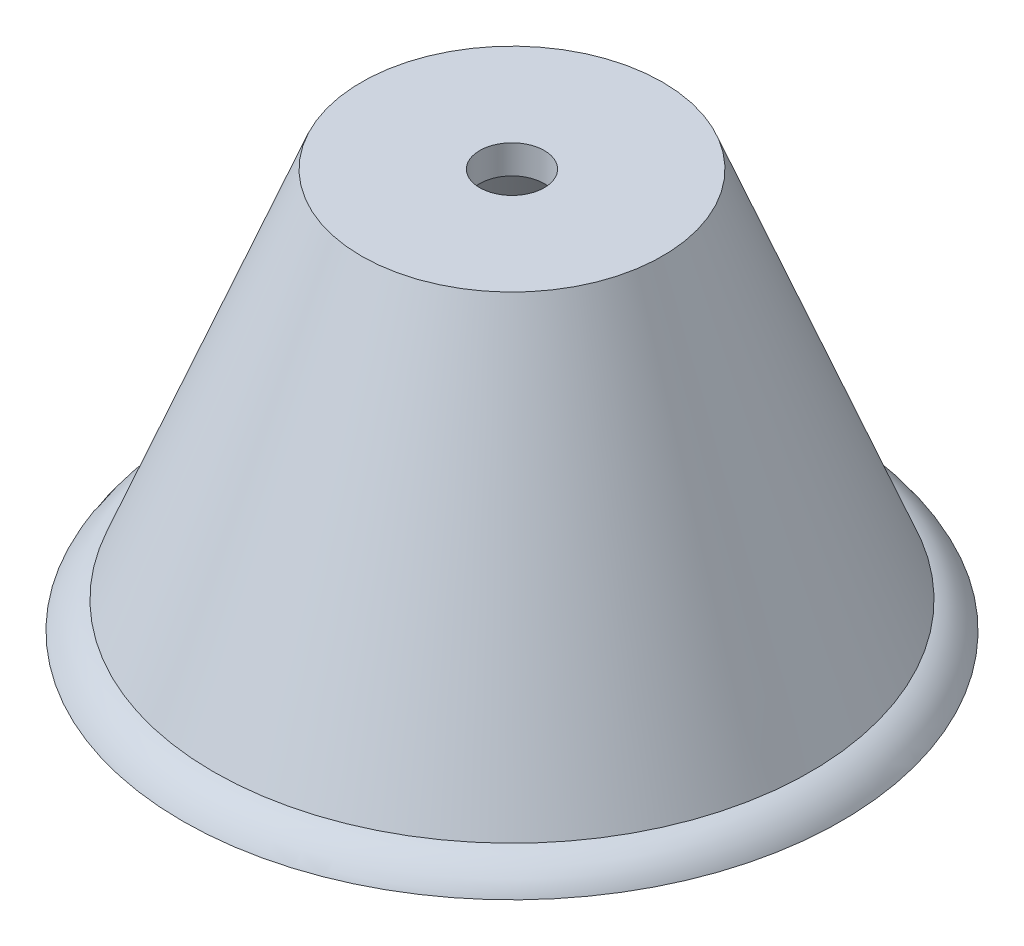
ISO-10303-21;
HEADER;
FILE_DESCRIPTION(('STEP AP214'),'2;1');
FILE_NAME('part.step','',(''),(''),'','','');
FILE_SCHEMA(('AUTOMOTIVE_DESIGN { 1 0 10303 214 1 1 1 1 }'));
ENDSEC;
DATA;
#1=APPLICATION_CONTEXT('core data for automotive mechanical design processes');
#2=APPLICATION_PROTOCOL_DEFINITION('international standard','automotive_design',2000,#1);
#3=PRODUCT_CONTEXT('',#1,'mechanical');
#4=PRODUCT('Part','Part','',(#3));
#5=PRODUCT_RELATED_PRODUCT_CATEGORY('part','',(#4));
#6=PRODUCT_DEFINITION_FORMATION('','',#4);
#7=PRODUCT_DEFINITION_CONTEXT('part definition',#1,'design');
#8=PRODUCT_DEFINITION('design','',#6,#7);
#9=PRODUCT_DEFINITION_SHAPE('','',#8);
#10=(LENGTH_UNIT() NAMED_UNIT(*) SI_UNIT(.MILLI.,.METRE.));
#11=(NAMED_UNIT(*) PLANE_ANGLE_UNIT() SI_UNIT($,.RADIAN.));
#12=(NAMED_UNIT(*) SI_UNIT($,.STERADIAN.) SOLID_ANGLE_UNIT());
#13=UNCERTAINTY_MEASURE_WITH_UNIT(LENGTH_MEASURE(1.E-05),#10,'distance_accuracy_value','');
#14=(GEOMETRIC_REPRESENTATION_CONTEXT(3) GLOBAL_UNCERTAINTY_ASSIGNED_CONTEXT((#13)) GLOBAL_UNIT_ASSIGNED_CONTEXT((#10,
#11,#12)) REPRESENTATION_CONTEXT('',''));
#15=CARTESIAN_POINT('',(0.,0.,0.));
#16=DIRECTION('',(0.,0.,1.));
#17=DIRECTION('',(1.,0.,0.));
#18=AXIS2_PLACEMENT_3D('',#15,#16,#17);
#19=CARTESIAN_POINT('',(0.,6.05139598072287,0.));
#20=DIRECTION('',(0.,1.,0.));
#21=DIRECTION('',(0.,0.,1.));
#22=AXIS2_PLACEMENT_3D('',#19,#20,#21);
#23=PLANE('',#22);
#24=CARTESIAN_POINT('',(0.,6.05139598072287,0.));
#25=DIRECTION('',(0.,-1.,0.));
#26=DIRECTION('',(0.,0.,-1.));
#27=AXIS2_PLACEMENT_3D('',#24,#25,#26);
#28=CIRCLE('',#27,4.92799404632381);
#29=CARTESIAN_POINT('',(0.,6.05139598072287,-4.92799404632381));
#30=VERTEX_POINT('',#29);
#31=EDGE_CURVE('E53',#30,#30,#28,.T.);
#32=ORIENTED_EDGE('',*,*,#31,.F.);
#33=EDGE_LOOP('',(#32));
#34=FACE_BOUND('',#33,.T.);
#35=CARTESIAN_POINT('',(0.,6.05139598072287,0.));
#36=DIRECTION('',(0.,-1.,0.));
#37=DIRECTION('',(0.,0.,-1.));
#38=AXIS2_PLACEMENT_3D('',#35,#36,#37);
#39=CIRCLE('',#38,5.83544876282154);
#40=CARTESIAN_POINT('',(0.,6.05139598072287,-5.83544876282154));
#41=VERTEX_POINT('',#40);
#42=EDGE_CURVE('E10',#41,#41,#39,.T.);
#43=ORIENTED_EDGE('',*,*,#42,.T.);
#44=EDGE_LOOP('',(#43));
#45=FACE_BOUND('',#44,.T.);
#46=ADVANCED_FACE('F34',(#34,#45),#23,.F.);
#47=CARTESIAN_POINT('',(0.,5.69518983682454,0.));
#48=DIRECTION('',(0.,-1.,0.));
#49=DIRECTION('',(0.,0.,-1.));
#50=AXIS2_PLACEMENT_3D('',#47,#48,#49);
#51=TOROIDAL_SURFACE('',#50,5.04232932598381,0.869437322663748);
#52=CARTESIAN_POINT('',(0.,6.53018884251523,0.));
#53=DIRECTION('',(0.,-1.,0.));
#54=DIRECTION('',(0.,0.,-1.));
#55=AXIS2_PLACEMENT_3D('',#52,#53,#54);
#56=CIRCLE('',#55,5.28460585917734);
#57=CARTESIAN_POINT('',(0.,6.53018884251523,-5.28460585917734));
#58=VERTEX_POINT('',#57);
#59=EDGE_CURVE('E41',#58,#58,#56,.T.);
#60=ORIENTED_EDGE('',*,*,#59,.T.);
#61=EDGE_LOOP('',(#60));
#62=FACE_BOUND('',#61,.T.);
#63=ORIENTED_EDGE('',*,*,#42,.F.);
#64=EDGE_LOOP('',(#63));
#65=FACE_BOUND('',#64,.T.);
#66=ADVANCED_FACE('F82',(#62,#65),#51,.T.);
#67=CARTESIAN_POINT('',(0.,13.1307286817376,0.));
#68=DIRECTION('',(0.,-1.,0.));
#69=DIRECTION('',(0.,0.,-1.));
#70=AXIS2_PLACEMENT_3D('',#67,#68,#69);
#71=CONICAL_SURFACE('',#70,2.667,0.377549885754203);
#72=ORIENTED_EDGE('',*,*,#59,.F.);
#73=EDGE_LOOP('',(#72));
#74=FACE_BOUND('',#73,.T.);
#75=CARTESIAN_POINT('',(0.,13.1307286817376,0.));
#76=DIRECTION('',(0.,-1.,0.));
#77=DIRECTION('',(0.,0.,-1.));
#78=AXIS2_PLACEMENT_3D('',#75,#76,#77);
#79=CIRCLE('',#78,2.667);
#80=CARTESIAN_POINT('',(0.,13.1307286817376,-2.667));
#81=VERTEX_POINT('',#80);
#82=EDGE_CURVE('E45',#81,#81,#79,.T.);
#83=ORIENTED_EDGE('',*,*,#82,.T.);
#84=EDGE_LOOP('',(#83));
#85=FACE_BOUND('',#84,.T.);
#86=ADVANCED_FACE('F87',(#74,#85),#71,.T.);
#87=CARTESIAN_POINT('',(0.,13.1307286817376,0.));
#88=DIRECTION('',(0.,-1.,0.));
#89=DIRECTION('',(0.,0.,-1.));
#90=AXIS2_PLACEMENT_3D('',#87,#88,#89);
#91=PLANE('',#90);
#92=CARTESIAN_POINT('',(0.,13.1307286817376,0.));
#93=DIRECTION('',(0.,-1.,0.));
#94=DIRECTION('',(0.,0.,-1.));
#95=AXIS2_PLACEMENT_3D('',#92,#93,#94);
#96=CIRCLE('',#95,0.5715);
#97=CARTESIAN_POINT('',(0.,13.1307286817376,-0.5715));
#98=VERTEX_POINT('',#97);
#99=EDGE_CURVE('E56',#98,#98,#96,.T.);
#100=ORIENTED_EDGE('',*,*,#99,.T.);
#101=EDGE_LOOP('',(#100));
#102=FACE_BOUND('',#101,.T.);
#103=ORIENTED_EDGE('',*,*,#82,.F.);
#104=EDGE_LOOP('',(#103));
#105=FACE_BOUND('',#104,.T.);
#106=ADVANCED_FACE('F70',(#102,#105),#91,.F.);
#107=CARTESIAN_POINT('',(0.,12.6227286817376,0.));
#108=DIRECTION('',(0.,-1.,0.));
#109=DIRECTION('',(0.,0.,-1.));
#110=AXIS2_PLACEMENT_3D('',#107,#108,#109);
#111=PLANE('',#110);
#112=CARTESIAN_POINT('',(0.,12.6227286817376,0.));
#113=DIRECTION('',(0.,-1.,0.));
#114=DIRECTION('',(0.,0.,-1.));
#115=AXIS2_PLACEMENT_3D('',#112,#113,#114);
#116=CIRCLE('',#115,0.5715);
#117=CARTESIAN_POINT('',(0.,12.6227286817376,-0.5715));
#118=VERTEX_POINT('',#117);
#119=EDGE_CURVE('E37',#118,#118,#116,.T.);
#120=ORIENTED_EDGE('',*,*,#119,.F.);
#121=EDGE_LOOP('',(#120));
#122=FACE_BOUND('',#121,.T.);
#123=CARTESIAN_POINT('',(0.,12.6227286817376,0.));
#124=DIRECTION('',(0.,-1.,0.));
#125=DIRECTION('',(0.,0.,-1.));
#126=AXIS2_PLACEMENT_3D('',#123,#124,#125);
#127=CIRCLE('',#126,2.32197099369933);
#128=CARTESIAN_POINT('',(0.,12.6227286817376,-2.32197099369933));
#129=VERTEX_POINT('',#128);
#130=EDGE_CURVE('E50',#129,#129,#127,.T.);
#131=ORIENTED_EDGE('',*,*,#130,.T.);
#132=EDGE_LOOP('',(#131));
#133=FACE_BOUND('',#132,.T.);
#134=ADVANCED_FACE('F66',(#122,#133),#111,.T.);
#135=CARTESIAN_POINT('',(0.,12.6227286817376,0.));
#136=DIRECTION('',(0.,-1.,0.));
#137=DIRECTION('',(0.,0.,-1.));
#138=AXIS2_PLACEMENT_3D('',#135,#136,#137);
#139=CONICAL_SURFACE('',#138,2.32197099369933,0.377549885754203);
#140=ORIENTED_EDGE('',*,*,#31,.T.);
#141=EDGE_LOOP('',(#140));
#142=FACE_BOUND('',#141,.T.);
#143=ORIENTED_EDGE('',*,*,#130,.F.);
#144=EDGE_LOOP('',(#143));
#145=FACE_BOUND('',#144,.T.);
#146=ADVANCED_FACE('F69',(#142,#145),#139,.F.);
#147=CARTESIAN_POINT('',(0.,-2.68214638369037,0.));
#148=DIRECTION('',(0.,-1.,0.));
#149=DIRECTION('',(0.,0.,-1.));
#150=AXIS2_PLACEMENT_3D('',#147,#148,#149);
#151=CYLINDRICAL_SURFACE('',#150,0.5715);
#152=ORIENTED_EDGE('',*,*,#119,.T.);
#153=EDGE_LOOP('',(#152));
#154=FACE_BOUND('',#153,.T.);
#155=ORIENTED_EDGE('',*,*,#99,.F.);
#156=EDGE_LOOP('',(#155));
#157=FACE_BOUND('',#156,.T.);
#158=ADVANCED_FACE('F63',(#154,#157),#151,.F.);
#159=CLOSED_SHELL('',(#46,#66,#86,#106,#134,#146,#158));
#160=MANIFOLD_SOLID_BREP('B2',#159);
#161=ADVANCED_BREP_SHAPE_REPRESENTATION('',(#18,#160),#14);
#162=SHAPE_DEFINITION_REPRESENTATION(#9,#161);
ENDSEC;
END-ISO-10303-21;
